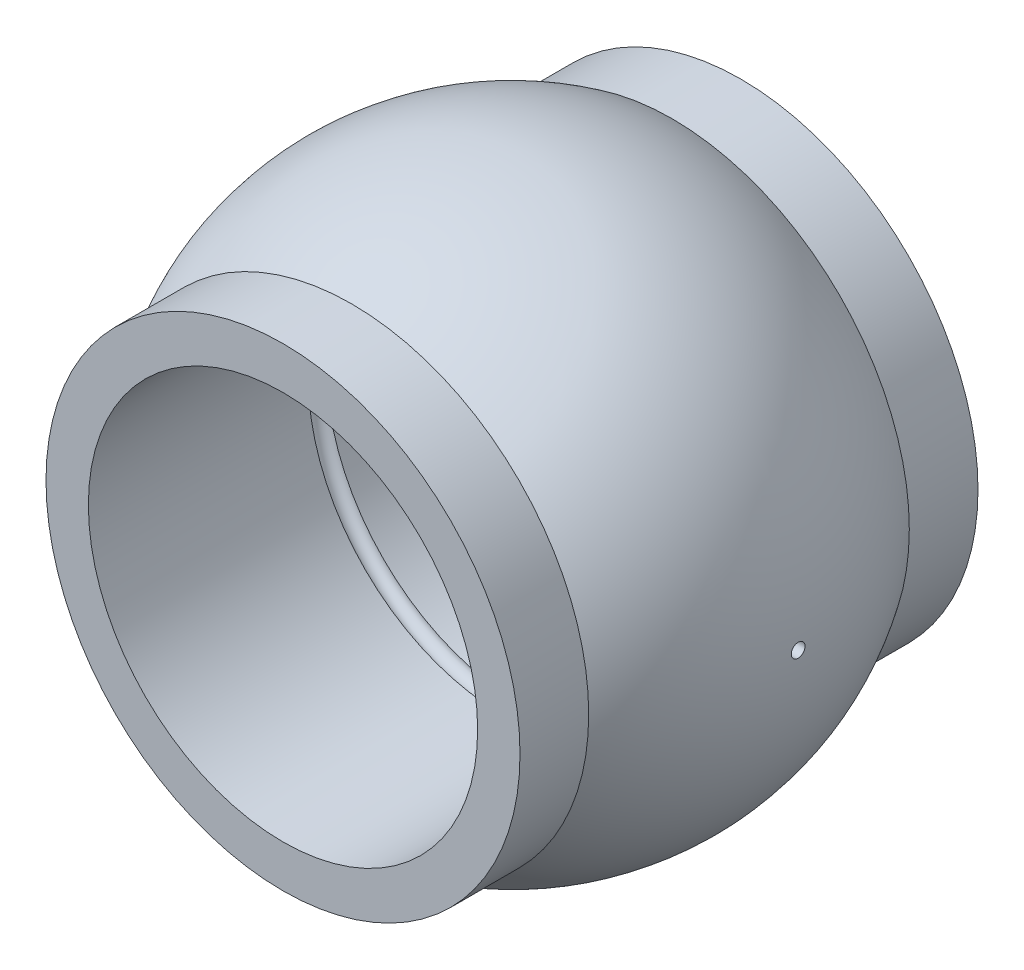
ISO-10303-21;
HEADER;
FILE_DESCRIPTION(('STEP AP214'),'2;1');
FILE_NAME('part.step','',(''),(''),'','','');
FILE_SCHEMA(('AUTOMOTIVE_DESIGN { 1 0 10303 214 1 1 1 1 }'));
ENDSEC;
DATA;
#1=APPLICATION_CONTEXT('core data for automotive mechanical design processes');
#2=APPLICATION_PROTOCOL_DEFINITION('international standard','automotive_design',2000,#1);
#3=PRODUCT_CONTEXT('',#1,'mechanical');
#4=PRODUCT('Part','Part','',(#3));
#5=PRODUCT_RELATED_PRODUCT_CATEGORY('part','',(#4));
#6=PRODUCT_DEFINITION_FORMATION('','',#4);
#7=PRODUCT_DEFINITION_CONTEXT('part definition',#1,'design');
#8=PRODUCT_DEFINITION('design','',#6,#7);
#9=PRODUCT_DEFINITION_SHAPE('','',#8);
#10=(LENGTH_UNIT() NAMED_UNIT(*) SI_UNIT(.MILLI.,.METRE.));
#11=(NAMED_UNIT(*) PLANE_ANGLE_UNIT() SI_UNIT($,.RADIAN.));
#12=(NAMED_UNIT(*) SI_UNIT($,.STERADIAN.) SOLID_ANGLE_UNIT());
#13=UNCERTAINTY_MEASURE_WITH_UNIT(LENGTH_MEASURE(1.E-05),#10,'distance_accuracy_value','');
#14=(GEOMETRIC_REPRESENTATION_CONTEXT(3) GLOBAL_UNCERTAINTY_ASSIGNED_CONTEXT((#13)) GLOBAL_UNIT_ASSIGNED_CONTEXT((#10,
#11,#12)) REPRESENTATION_CONTEXT('',''));
#15=CARTESIAN_POINT('',(0.,0.,0.));
#16=DIRECTION('',(0.,0.,1.));
#17=DIRECTION('',(1.,0.,0.));
#18=AXIS2_PLACEMENT_3D('',#15,#16,#17);
#19=CARTESIAN_POINT('',(69.,0.,0.));
#20=DIRECTION('',(0.,0.,-1.));
#21=DIRECTION('',(-1.,0.,0.));
#22=AXIS2_PLACEMENT_3D('',#19,#20,#21);
#23=TOROIDAL_SURFACE('',#22,8.50000000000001,0.4);
#24=CARTESIAN_POINT('',(69.,0.,-0.4));
#25=DIRECTION('',(0.,0.,-1.));
#26=DIRECTION('',(-1.,0.,0.));
#27=AXIS2_PLACEMENT_3D('',#24,#25,#26);
#28=CIRCLE('',#27,8.50000000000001);
#29=CARTESIAN_POINT('',(60.5,0.,-0.4));
#30=VERTEX_POINT('',#29);
#31=EDGE_CURVE('E36',#30,#30,#28,.T.);
#32=ORIENTED_EDGE('',*,*,#31,.T.);
#33=EDGE_LOOP('',(#32));
#34=FACE_BOUND('',#33,.T.);
#35=CARTESIAN_POINT('',(60.2354248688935,0.,0.299999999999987));
#36=CARTESIAN_POINT('',(60.235421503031,0.0141221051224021,0.299998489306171));
#37=CARTESIAN_POINT('',(60.2343019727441,0.0282560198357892,0.298991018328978));
#38=CARTESIAN_POINT('',(60.2300895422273,0.0559648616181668,0.295068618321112));
#39=CARTESIAN_POINT('',(60.2269907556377,0.0695379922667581,0.292147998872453));
#40=CARTESIAN_POINT('',(60.2194652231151,0.0956030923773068,0.284678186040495));
#41=CARTESIAN_POINT('',(60.21505681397,0.108107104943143,0.280151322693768));
#42=CARTESIAN_POINT('',(60.205446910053,0.132145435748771,0.269647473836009));
#43=CARTESIAN_POINT('',(60.2002454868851,0.143679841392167,0.26367061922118));
#44=CARTESIAN_POINT('',(60.1883802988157,0.168029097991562,0.249013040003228));
#45=CARTESIAN_POINT('',(60.1816352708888,0.180622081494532,0.240029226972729));
#46=CARTESIAN_POINT('',(60.1682070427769,0.204319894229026,0.220209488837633));
#47=CARTESIAN_POINT('',(60.1615239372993,0.215422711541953,0.209371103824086));
#48=CARTESIAN_POINT('',(60.1475351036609,0.237852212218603,0.183757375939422));
#49=CARTESIAN_POINT('',(60.1403400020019,0.24884644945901,0.168624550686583));
#50=CARTESIAN_POINT('',(60.1274966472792,0.268017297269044,0.136091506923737));
#51=CARTESIAN_POINT('',(60.1218450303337,0.276200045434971,0.118696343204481));
#52=CARTESIAN_POINT('',(60.1140704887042,0.287326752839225,0.0873811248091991));
#53=CARTESIAN_POINT('',(60.1114006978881,0.291099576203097,0.0738887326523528));
#54=CARTESIAN_POINT('',(60.1073968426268,0.296734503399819,0.0463239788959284));
#55=CARTESIAN_POINT('',(60.1060613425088,0.298598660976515,0.0322522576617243));
#56=CARTESIAN_POINT('',(60.1048344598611,0.300311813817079,0.00388974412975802));
#57=CARTESIAN_POINT('',(60.104946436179,0.300156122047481,-0.0104014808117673));
#58=CARTESIAN_POINT('',(60.1066121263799,0.297828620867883,-0.0387335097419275));
#59=CARTESIAN_POINT('',(60.108166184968,0.29565632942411,-0.0527742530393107));
#60=CARTESIAN_POINT('',(60.1125247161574,0.289510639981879,-0.0798144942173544));
#61=CARTESIAN_POINT('',(60.1152921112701,0.285590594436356,-0.092832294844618));
#62=CARTESIAN_POINT('',(60.1218698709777,0.276146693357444,-0.118002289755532));
#63=CARTESIAN_POINT('',(60.1256821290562,0.27061992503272,-0.130152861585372));
#64=CARTESIAN_POINT('',(60.139240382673,0.25061573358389,-0.16744621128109));
#65=CARTESIAN_POINT('',(60.1505986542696,0.233380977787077,-0.190589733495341));
#66=CARTESIAN_POINT('',(60.1696494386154,0.201834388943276,-0.22258785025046));
#67=CARTESIAN_POINT('',(60.1769600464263,0.189172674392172,-0.233430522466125));
#68=CARTESIAN_POINT('',(60.1913694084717,0.162170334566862,-0.252941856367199));
#69=CARTESIAN_POINT('',(60.1984680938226,0.147829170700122,-0.261609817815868));
#70=CARTESIAN_POINT('',(60.2153217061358,0.108867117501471,-0.28078414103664));
#71=CARTESIAN_POINT('',(60.2243561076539,0.0829672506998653,-0.28962870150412));
#72=CARTESIAN_POINT('',(60.2316145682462,0.0466256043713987,-0.296499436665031));
#73=CARTESIAN_POINT('',(60.2330292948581,0.0374038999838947,-0.297806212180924));
#74=CARTESIAN_POINT('',(60.2349350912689,0.0187897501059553,-0.299556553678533));
#75=CARTESIAN_POINT('',(60.2354271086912,0.00939748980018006,-0.300001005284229));
#76=CARTESIAN_POINT('',(60.235421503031,-0.0141221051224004,-0.299998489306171));
#77=CARTESIAN_POINT('',(60.2343019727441,-0.0282560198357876,-0.298991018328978));
#78=CARTESIAN_POINT('',(60.2300895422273,-0.055964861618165,-0.295068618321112));
#79=CARTESIAN_POINT('',(60.2269907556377,-0.0695379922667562,-0.292147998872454));
#80=CARTESIAN_POINT('',(60.2194652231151,-0.0956030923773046,-0.284678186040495));
#81=CARTESIAN_POINT('',(60.21505681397,-0.108107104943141,-0.280151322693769));
#82=CARTESIAN_POINT('',(60.205446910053,-0.132145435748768,-0.26964747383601));
#83=CARTESIAN_POINT('',(60.2002454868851,-0.143679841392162,-0.263670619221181));
#84=CARTESIAN_POINT('',(60.1883802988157,-0.168029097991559,-0.249013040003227));
#85=CARTESIAN_POINT('',(60.1816352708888,-0.180622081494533,-0.240029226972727));
#86=CARTESIAN_POINT('',(60.1682070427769,-0.20431989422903,-0.220209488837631));
#87=CARTESIAN_POINT('',(60.1615239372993,-0.215422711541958,-0.209371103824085));
#88=CARTESIAN_POINT('',(60.1475351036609,-0.237852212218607,-0.183757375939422));
#89=CARTESIAN_POINT('',(60.1403400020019,-0.248846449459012,-0.168624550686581));
#90=CARTESIAN_POINT('',(60.1274966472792,-0.268017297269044,-0.136091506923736));
#91=CARTESIAN_POINT('',(60.1218450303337,-0.276200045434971,-0.118696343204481));
#92=CARTESIAN_POINT('',(60.1140704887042,-0.287326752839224,-0.0873811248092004));
#93=CARTESIAN_POINT('',(60.1114006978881,-0.291099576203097,-0.073888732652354));
#94=CARTESIAN_POINT('',(60.1073968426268,-0.296734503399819,-0.0463239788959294));
#95=CARTESIAN_POINT('',(60.1060613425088,-0.298598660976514,-0.0322522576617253));
#96=CARTESIAN_POINT('',(60.1048344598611,-0.300311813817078,-0.00388974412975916));
#97=CARTESIAN_POINT('',(60.104946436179,-0.30015612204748,0.0104014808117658));
#98=CARTESIAN_POINT('',(60.1066121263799,-0.297828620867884,0.0387335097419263));
#99=CARTESIAN_POINT('',(60.108166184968,-0.295656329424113,0.0527742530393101));
#100=CARTESIAN_POINT('',(60.1125247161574,-0.289510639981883,0.0798144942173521));
#101=CARTESIAN_POINT('',(60.1152921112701,-0.285590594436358,0.0928322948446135));
#102=CARTESIAN_POINT('',(60.1218698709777,-0.276146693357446,0.118002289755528));
#103=CARTESIAN_POINT('',(60.1256821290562,-0.270619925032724,0.130152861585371));
#104=CARTESIAN_POINT('',(60.139240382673,-0.250615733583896,0.167446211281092));
#105=CARTESIAN_POINT('',(60.1505986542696,-0.233380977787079,0.190589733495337));
#106=CARTESIAN_POINT('',(60.1696494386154,-0.201834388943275,0.222587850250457));
#107=CARTESIAN_POINT('',(60.1769600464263,-0.189172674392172,0.233430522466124));
#108=CARTESIAN_POINT('',(60.1913694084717,-0.162170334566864,0.252941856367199));
#109=CARTESIAN_POINT('',(60.1984680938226,-0.147829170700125,0.261609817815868));
#110=CARTESIAN_POINT('',(60.2153217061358,-0.108867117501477,0.280784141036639));
#111=CARTESIAN_POINT('',(60.2243561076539,-0.0829672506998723,0.289628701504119));
#112=CARTESIAN_POINT('',(60.2316145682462,-0.0466256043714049,0.29649943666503));
#113=CARTESIAN_POINT('',(60.2330292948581,-0.0374038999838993,0.297806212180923));
#114=CARTESIAN_POINT('',(60.2349350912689,-0.0187897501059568,0.299556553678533));
#115=CARTESIAN_POINT('',(60.2354271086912,-0.00939748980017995,0.300001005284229));
#116=CARTESIAN_POINT('',(60.2354248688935,0.,0.299999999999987));
#117=B_SPLINE_CURVE_WITH_KNOTS('',3,(#35,#36,#37,#38,#39,#40,#41,#42,#43,#44,#45,#46,#47,#48,
#49,#50,#51,#52,#53,#54,#55,#56,#57,#58,#59,#60,#61,#62,#63,#64,#65,#66,#67,#68,#69,#70,#71,#72,
#73,#74,#75,#76,#77,#78,#79,#80,#81,#82,#83,#84,#85,#86,#87,#88,#89,#90,#91,#92,#93,#94,#95,#96,
#97,#98,#99,#100,#101,#102,#103,#104,#105,#106,#107,#108,#109,#110,#111,#112,#113,#114,#115,
#116),.UNSPECIFIED.,.T.,.F.,(4,2,2,2,2,2,2,2,2,2,2,2,2,2,2,2,2,2,2,2,2,2,2,2,2,2,2,2,2,2,2,2,2,
2,2,2,2,2,2,2,4),(0.,0.0423173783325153,0.0847611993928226,0.12663670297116,0.168508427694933,
0.218959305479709,0.269477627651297,0.329261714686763,0.388914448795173,0.431518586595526,
0.47407683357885,0.51673385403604,0.559401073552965,0.600846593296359,0.642367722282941,
0.733952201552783,0.78838717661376,0.842839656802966,0.927598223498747,0.9557870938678,
0.983946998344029,1.02626437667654,1.06870819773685,1.11058370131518,1.15245542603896,
1.20290630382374,1.25342462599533,1.31320871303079,1.3728614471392,1.41546558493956,
1.45802383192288,1.50068085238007,1.54334807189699,1.58479359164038,1.62631472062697,
1.71789919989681,1.77233417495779,1.82678665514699,1.91154522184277,1.93973409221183,
1.96789399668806),.UNSPECIFIED.);
#118=CARTESIAN_POINT('',(60.2354248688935,0.,0.299999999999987));
#119=VERTEX_POINT('',#118);
#120=EDGE_CURVE('E19',#119,#119,#117,.T.);
#121=ORIENTED_EDGE('',*,*,#120,.T.);
#122=EDGE_LOOP('',(#121));
#123=FACE_BOUND('',#122,.T.);
#124=CARTESIAN_POINT('',(69.,0.,0.4));
#125=DIRECTION('',(0.,0.,-1.));
#126=DIRECTION('',(-1.,0.,0.));
#127=AXIS2_PLACEMENT_3D('',#124,#125,#126);
#128=CIRCLE('',#127,8.5);
#129=CARTESIAN_POINT('',(60.5,0.,0.4));
#130=VERTEX_POINT('',#129);
#131=EDGE_CURVE('E39',#130,#130,#128,.F.);
#132=ORIENTED_EDGE('',*,*,#131,.T.);
#133=EDGE_LOOP('',(#132));
#134=FACE_BOUND('',#133,.T.);
#135=CARTESIAN_POINT('',(77.7645751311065,-4.96544178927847E-12,-0.299999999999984));
#136=CARTESIAN_POINT('',(77.7645784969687,0.0141221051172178,-0.299998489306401));
#137=CARTESIAN_POINT('',(77.7656980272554,0.0282560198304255,-0.298991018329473));
#138=CARTESIAN_POINT('',(77.7699104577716,0.055964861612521,-0.29506861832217));
#139=CARTESIAN_POINT('',(77.7730092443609,0.06953799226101,-0.292147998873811));
#140=CARTESIAN_POINT('',(77.780534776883,0.0956030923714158,-0.284678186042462));
#141=CARTESIAN_POINT('',(77.7849431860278,0.10810710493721,-0.280151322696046));
#142=CARTESIAN_POINT('',(77.7945530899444,0.132145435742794,-0.269647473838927));
#143=CARTESIAN_POINT('',(77.7997545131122,0.143679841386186,-0.263670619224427));
#144=CARTESIAN_POINT('',(77.8116197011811,0.168029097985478,-0.249013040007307));
#145=CARTESIAN_POINT('',(77.8183647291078,0.18062208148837,-0.240029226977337));
#146=CARTESIAN_POINT('',(77.8317929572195,0.204319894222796,-0.220209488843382));
#147=CARTESIAN_POINT('',(77.8384760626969,0.215422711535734,-0.209371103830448));
#148=CARTESIAN_POINT('',(77.8524648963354,0.23785221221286,-0.183757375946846));
#149=CARTESIAN_POINT('',(77.8596599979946,0.248846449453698,-0.168624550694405));
#150=CARTESIAN_POINT('',(77.8725033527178,0.268017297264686,-0.136091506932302));
#151=CARTESIAN_POINT('',(77.8781549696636,0.276200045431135,-0.118696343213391));
#152=CARTESIAN_POINT('',(77.8859295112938,0.287326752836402,-0.087381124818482));
#153=CARTESIAN_POINT('',(77.8885993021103,0.291099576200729,-0.0738887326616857));
#154=CARTESIAN_POINT('',(77.8926031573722,0.296734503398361,-0.0463239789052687));
#155=CARTESIAN_POINT('',(77.8939386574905,0.298598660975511,-0.0322522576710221));
#156=CARTESIAN_POINT('',(77.8951655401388,0.300311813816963,-0.00388974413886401));
#157=CARTESIAN_POINT('',(77.8950535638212,0.300156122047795,0.0104014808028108));
#158=CARTESIAN_POINT('',(77.8933878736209,0.297828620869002,0.0387335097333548));
#159=CARTESIAN_POINT('',(77.8918338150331,0.295656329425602,0.0527742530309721));
#160=CARTESIAN_POINT('',(77.8874752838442,0.289510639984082,0.0798144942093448));
#161=CARTESIAN_POINT('',(77.8847078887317,0.285590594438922,0.0928322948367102));
#162=CARTESIAN_POINT('',(77.8781301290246,0.276146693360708,0.118002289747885));
#163=CARTESIAN_POINT('',(77.8743178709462,0.270619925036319,0.130152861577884));
#164=CARTESIAN_POINT('',(77.8607596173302,0.250615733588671,0.167446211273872));
#165=CARTESIAN_POINT('',(77.8494013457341,0.23338097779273,0.190589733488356));
#166=CARTESIAN_POINT('',(77.8303505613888,0.201834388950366,0.222587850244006));
#167=CARTESIAN_POINT('',(77.8230399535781,0.189172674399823,0.233430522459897));
#168=CARTESIAN_POINT('',(77.8086305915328,0.162170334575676,0.252941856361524));
#169=CARTESIAN_POINT('',(77.8015319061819,0.147829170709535,0.261609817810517));
#170=CARTESIAN_POINT('',(77.7846782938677,0.108867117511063,0.280784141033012));
#171=CARTESIAN_POINT('',(77.7756438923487,0.0829672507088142,0.289628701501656));
#172=CARTESIAN_POINT('',(77.768385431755,0.0466256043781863,0.296499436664));
#173=CARTESIAN_POINT('',(77.7669707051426,0.0374038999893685,0.297806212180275));
#174=CARTESIAN_POINT('',(77.7650649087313,0.0187897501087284,0.299556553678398));
#175=CARTESIAN_POINT('',(77.7645728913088,0.00939748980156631,0.300001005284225));
#176=CARTESIAN_POINT('',(77.764578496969,-0.0141221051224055,0.299998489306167));
#177=CARTESIAN_POINT('',(77.7656980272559,-0.0282560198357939,0.298991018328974));
#178=CARTESIAN_POINT('',(77.7699104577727,-0.0559648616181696,0.295068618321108));
#179=CARTESIAN_POINT('',(77.7730092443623,-0.0695379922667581,0.29214799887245));
#180=CARTESIAN_POINT('',(77.780534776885,-0.0956030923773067,0.284678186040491));
#181=CARTESIAN_POINT('',(77.78494318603,-0.108107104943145,0.280151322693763));
#182=CARTESIAN_POINT('',(77.794553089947,-0.132145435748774,0.269647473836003));
#183=CARTESIAN_POINT('',(77.7997545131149,-0.143679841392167,0.263670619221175));
#184=CARTESIAN_POINT('',(77.8116197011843,-0.168029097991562,0.249013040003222));
#185=CARTESIAN_POINT('',(77.8183647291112,-0.180622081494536,0.240029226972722));
#186=CARTESIAN_POINT('',(77.8317929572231,-0.204319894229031,0.220209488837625));
#187=CARTESIAN_POINT('',(77.8384760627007,-0.215422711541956,0.209371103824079));
#188=CARTESIAN_POINT('',(77.8524648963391,-0.237852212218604,0.183757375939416));
#189=CARTESIAN_POINT('',(77.8596599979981,-0.24884644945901,0.168624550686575));
#190=CARTESIAN_POINT('',(77.8725033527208,-0.268017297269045,0.136091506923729));
#191=CARTESIAN_POINT('',(77.8781549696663,-0.276200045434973,0.118696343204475));
#192=CARTESIAN_POINT('',(77.8859295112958,-0.287326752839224,0.0873811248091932));
#193=CARTESIAN_POINT('',(77.8885993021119,-0.291099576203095,0.0738887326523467));
#194=CARTESIAN_POINT('',(77.8926031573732,-0.296734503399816,0.046323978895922));
#195=CARTESIAN_POINT('',(77.8939386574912,-0.298598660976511,0.0322522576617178));
#196=CARTESIAN_POINT('',(77.8951655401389,-0.300311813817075,0.00388974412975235));
#197=CARTESIAN_POINT('',(77.895053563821,-0.300156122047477,-0.0104014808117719));
#198=CARTESIAN_POINT('',(77.8933878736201,-0.297828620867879,-0.0387335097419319));
#199=CARTESIAN_POINT('',(77.891833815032,-0.295656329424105,-0.0527742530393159));
#200=CARTESIAN_POINT('',(77.8874752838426,-0.289510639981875,-0.0798144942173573));
#201=CARTESIAN_POINT('',(77.8847078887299,-0.285590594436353,-0.0928322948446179));
#202=CARTESIAN_POINT('',(77.8781301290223,-0.27614669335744,-0.118002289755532));
#203=CARTESIAN_POINT('',(77.8743178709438,-0.270619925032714,-0.130152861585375));
#204=CARTESIAN_POINT('',(77.860759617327,-0.250615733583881,-0.167446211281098));
#205=CARTESIAN_POINT('',(77.8494013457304,-0.233380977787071,-0.190589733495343));
#206=CARTESIAN_POINT('',(77.8303505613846,-0.201834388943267,-0.222587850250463));
#207=CARTESIAN_POINT('',(77.8230399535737,-0.189172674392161,-0.233430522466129));
#208=CARTESIAN_POINT('',(77.8086305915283,-0.162170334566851,-0.252941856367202));
#209=CARTESIAN_POINT('',(77.8015319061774,-0.147829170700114,-0.261609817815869));
#210=CARTESIAN_POINT('',(77.7846782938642,-0.108867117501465,-0.280784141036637));
#211=CARTESIAN_POINT('',(77.7756438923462,-0.0829672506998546,-0.289628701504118));
#212=CARTESIAN_POINT('',(77.768385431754,-0.0466256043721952,-0.296499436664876));
#213=CARTESIAN_POINT('',(77.7669707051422,-0.0374038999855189,-0.29780621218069));
#214=CARTESIAN_POINT('',(77.7650649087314,-0.0187897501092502,-0.299556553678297));
#215=CARTESIAN_POINT('',(77.764572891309,-0.00939748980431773,-0.30000100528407));
#216=CARTESIAN_POINT('',(77.7645751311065,-4.96544178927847E-12,-0.299999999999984));
#217=B_SPLINE_CURVE_WITH_KNOTS('',3,(#135,#136,#137,#138,#139,#140,#141,#142,#143,#144,#145,
#146,#147,#148,#149,#150,#151,#152,#153,#154,#155,#156,#157,#158,#159,#160,#161,#162,#163,#164,
#165,#166,#167,#168,#169,#170,#171,#172,#173,#174,#175,#176,#177,#178,#179,#180,#181,#182,#183,
#184,#185,#186,#187,#188,#189,#190,#191,#192,#193,#194,#195,#196,#197,#198,#199,#200,#201,#202,
#203,#204,#205,#206,#207,#208,#209,#210,#211,#212,#213,#214,#215,#216),.UNSPECIFIED.,.T.,.F.,(4,
2,2,2,2,2,2,2,2,2,2,2,2,2,2,2,2,2,2,2,2,2,2,2,2,2,2,2,2,2,2,2,2,2,2,2,2,2,2,2,4),(0.,
0.042317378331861,0.0847611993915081,0.126636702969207,0.168508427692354,0.218959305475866,
0.269477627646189,0.329261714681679,0.388914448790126,0.431518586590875,0.474076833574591,
0.516733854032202,0.559401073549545,0.600846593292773,0.642367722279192,0.733952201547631,
0.788387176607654,0.842839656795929,0.927598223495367,0.95578709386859,0.983946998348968,
1.02626437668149,1.0687081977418,1.11058370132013,1.15245542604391,1.20290630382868,
1.25342462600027,1.31320871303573,1.37286144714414,1.4154655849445,1.45802383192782,
1.50068085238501,1.54334807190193,1.58479359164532,1.6263147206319,1.71789919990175,
1.77233417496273,1.82678665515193,1.91154522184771,1.93973409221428,1.96789399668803),.UNSPECIFIED.);
#218=CARTESIAN_POINT('',(77.7645751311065,-4.96544178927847E-12,-0.299999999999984));
#219=VERTEX_POINT('',#218);
#220=EDGE_CURVE('E89',#219,#219,#217,.T.);
#221=ORIENTED_EDGE('',*,*,#220,.T.);
#222=EDGE_LOOP('',(#221));
#223=FACE_BOUND('',#222,.T.);
#224=ADVANCED_FACE('F14',(#34,#123,#134,#223),#23,.F.);
#225=CARTESIAN_POINT('',(69.,0.,7.));
#226=DIRECTION('',(0.,0.,-1.));
#227=DIRECTION('',(-1.,0.,0.));
#228=AXIS2_PLACEMENT_3D('',#225,#226,#227);
#229=CYLINDRICAL_SURFACE('',#228,8.5);
#230=CARTESIAN_POINT('',(69.,0.,10.));
#231=DIRECTION('',(0.,0.,-1.));
#232=DIRECTION('',(-1.,0.,0.));
#233=AXIS2_PLACEMENT_3D('',#230,#231,#232);
#234=CIRCLE('',#233,8.5);
#235=CARTESIAN_POINT('',(60.5,0.,10.));
#236=VERTEX_POINT('',#235);
#237=EDGE_CURVE('E85',#236,#236,#234,.T.);
#238=ORIENTED_EDGE('',*,*,#237,.F.);
#239=EDGE_LOOP('',(#238));
#240=FACE_BOUND('',#239,.T.);
#241=ORIENTED_EDGE('',*,*,#131,.F.);
#242=EDGE_LOOP('',(#241));
#243=FACE_BOUND('',#242,.T.);
#244=ADVANCED_FACE('F121',(#240,#243),#229,.F.);
#245=CARTESIAN_POINT('',(69.,0.,7.));
#246=DIRECTION('',(0.,0.,-1.));
#247=DIRECTION('',(-1.,0.,0.));
#248=AXIS2_PLACEMENT_3D('',#245,#246,#247);
#249=CYLINDRICAL_SURFACE('',#248,8.50000000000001);
#250=ORIENTED_EDGE('',*,*,#31,.F.);
#251=EDGE_LOOP('',(#250));
#252=FACE_BOUND('',#251,.T.);
#253=CARTESIAN_POINT('',(69.,0.,-10.));
#254=DIRECTION('',(0.,0.,-1.));
#255=DIRECTION('',(-1.,0.,0.));
#256=AXIS2_PLACEMENT_3D('',#253,#254,#255);
#257=CIRCLE('',#256,8.50000000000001);
#258=CARTESIAN_POINT('',(60.5,0.,-10.));
#259=VERTEX_POINT('',#258);
#260=EDGE_CURVE('E81',#259,#259,#257,.F.);
#261=ORIENTED_EDGE('',*,*,#260,.F.);
#262=EDGE_LOOP('',(#261));
#263=FACE_BOUND('',#262,.T.);
#264=ADVANCED_FACE('F118',(#252,#263),#249,.F.);
#265=CARTESIAN_POINT('',(69.,0.,10.));
#266=DIRECTION('',(0.,0.,1.));
#267=DIRECTION('',(1.,0.,0.));
#268=AXIS2_PLACEMENT_3D('',#265,#266,#267);
#269=PLANE('',#268);
#270=ORIENTED_EDGE('',*,*,#237,.T.);
#271=EDGE_LOOP('',(#270));
#272=FACE_BOUND('',#271,.T.);
#273=CARTESIAN_POINT('',(69.,0.,10.));
#274=DIRECTION('',(0.,0.,-1.));
#275=DIRECTION('',(-1.,0.,0.));
#276=AXIS2_PLACEMENT_3D('',#273,#274,#275);
#277=CIRCLE('',#276,10.3500000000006);
#278=CARTESIAN_POINT('',(58.6499999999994,0.,10.));
#279=VERTEX_POINT('',#278);
#280=EDGE_CURVE('E78',#279,#279,#277,.T.);
#281=ORIENTED_EDGE('',*,*,#280,.F.);
#282=EDGE_LOOP('',(#281));
#283=FACE_BOUND('',#282,.T.);
#284=ADVANCED_FACE('F110',(#272,#283),#269,.T.);
#285=CARTESIAN_POINT('',(69.,0.,-10.));
#286=DIRECTION('',(0.,0.,-1.));
#287=DIRECTION('',(-1.,0.,0.));
#288=AXIS2_PLACEMENT_3D('',#285,#286,#287);
#289=PLANE('',#288);
#290=CARTESIAN_POINT('',(69.,0.,-10.));
#291=DIRECTION('',(0.,0.,1.));
#292=DIRECTION('',(1.,0.,0.));
#293=AXIS2_PLACEMENT_3D('',#290,#291,#292);
#294=CIRCLE('',#293,10.3500000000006);
#295=CARTESIAN_POINT('',(79.3500000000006,0.,-10.));
#296=VERTEX_POINT('',#295);
#297=EDGE_CURVE('E80',#296,#296,#294,.T.);
#298=ORIENTED_EDGE('',*,*,#297,.F.);
#299=EDGE_LOOP('',(#298));
#300=FACE_BOUND('',#299,.T.);
#301=ORIENTED_EDGE('',*,*,#260,.T.);
#302=EDGE_LOOP('',(#301));
#303=FACE_BOUND('',#302,.T.);
#304=ADVANCED_FACE('F102',(#300,#303),#289,.T.);
#305=CARTESIAN_POINT('',(60.2354248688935,0.,0.));
#306=DIRECTION('',(1.,0.,0.));
#307=DIRECTION('',(0.,0.,-1.));
#308=AXIS2_PLACEMENT_3D('',#305,#306,#307);
#309=CYLINDRICAL_SURFACE('',#308,0.299999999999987);
#310=ORIENTED_EDGE('',*,*,#120,.F.);
#311=EDGE_LOOP('',(#310));
#312=FACE_BOUND('',#311,.T.);
#313=CARTESIAN_POINT('',(56.5036090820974,0.,0.299999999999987));
#314=CARTESIAN_POINT('',(56.5036090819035,-0.0168414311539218,0.299998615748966));
#315=CARTESIAN_POINT('',(56.5036090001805,-0.0336981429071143,0.298576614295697));
#316=CARTESIAN_POINT('',(56.5036086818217,-0.0669618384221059,0.292919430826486));
#317=CARTESIAN_POINT('',(56.5036084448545,-0.0833677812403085,0.288678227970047));
#318=CARTESIAN_POINT('',(56.5036078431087,-0.115207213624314,0.277508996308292));
#319=CARTESIAN_POINT('',(56.5036074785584,-0.130642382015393,0.270585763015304));
#320=CARTESIAN_POINT('',(56.5036066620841,-0.160153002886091,0.254236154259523));
#321=CARTESIAN_POINT('',(56.5036062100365,-0.174226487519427,0.244806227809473));
#322=CARTESIAN_POINT('',(56.503605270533,-0.200570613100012,0.223731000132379));
#323=CARTESIAN_POINT('',(56.503604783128,-0.21284376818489,0.212088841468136));
#324=CARTESIAN_POINT('',(56.503603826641,-0.235278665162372,0.186892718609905));
#325=CARTESIAN_POINT('',(56.5036033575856,-0.245437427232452,0.173336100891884));
#326=CARTESIAN_POINT('',(56.5036024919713,-0.263320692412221,0.144728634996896));
#327=CARTESIAN_POINT('',(56.5036020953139,-0.271048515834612,0.129679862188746));
#328=CARTESIAN_POINT('',(56.5036014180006,-0.283878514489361,0.0984779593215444));
#329=CARTESIAN_POINT('',(56.5036011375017,-0.288977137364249,0.0823233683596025));
#330=CARTESIAN_POINT('',(56.5036007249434,-0.296385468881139,0.0493983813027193));
#331=CARTESIAN_POINT('',(56.5036005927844,-0.298697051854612,0.0326284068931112));
#332=CARTESIAN_POINT('',(56.5036004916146,-0.300471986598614,-0.0010615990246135));
#333=CARTESIAN_POINT('',(56.5036005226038,-0.299935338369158,-0.0179816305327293));
#334=CARTESIAN_POINT('',(56.5036007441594,-0.296027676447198,-0.0515027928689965));
#335=CARTESIAN_POINT('',(56.5036009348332,-0.292654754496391,-0.0681037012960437));
#336=CARTESIAN_POINT('',(56.5036014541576,-0.283174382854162,-0.10048101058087));
#337=CARTESIAN_POINT('',(56.5036017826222,-0.277070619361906,-0.11625849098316));
#338=CARTESIAN_POINT('',(56.5036025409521,-0.262292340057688,-0.146586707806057));
#339=CARTESIAN_POINT('',(56.503602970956,-0.253614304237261,-0.161135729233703));
#340=CARTESIAN_POINT('',(56.5036038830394,-0.233951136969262,-0.188549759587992));
#341=CARTESIAN_POINT('',(56.5036043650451,-0.222969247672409,-0.201417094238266));
#342=CARTESIAN_POINT('',(56.5036053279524,-0.198985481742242,-0.225143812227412));
#343=CARTESIAN_POINT('',(56.5036058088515,-0.185980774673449,-0.23600033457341));
#344=CARTESIAN_POINT('',(56.5036067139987,-0.158351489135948,-0.255360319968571));
#345=CARTESIAN_POINT('',(56.5036071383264,-0.14372924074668,-0.263867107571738));
#346=CARTESIAN_POINT('',(56.503607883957,-0.113239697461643,-0.278320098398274));
#347=CARTESIAN_POINT('',(56.5036082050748,-0.0973702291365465,-0.284261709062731));
#348=CARTESIAN_POINT('',(56.5036087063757,-0.0648851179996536,-0.293382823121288));
#349=CARTESIAN_POINT('',(56.5036088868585,-0.0482711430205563,-0.296568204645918));
#350=CARTESIAN_POINT('',(56.5036090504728,-0.0210523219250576,-0.299446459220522));
#351=CARTESIAN_POINT('',(56.5036090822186,-0.0105291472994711,-0.300000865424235));
#352=CARTESIAN_POINT('',(56.5036090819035,0.0168414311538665,-0.299998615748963));
#353=CARTESIAN_POINT('',(56.5036090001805,0.0336981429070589,-0.2985766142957));
#354=CARTESIAN_POINT('',(56.5036086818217,0.0669618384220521,-0.292919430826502));
#355=CARTESIAN_POINT('',(56.5036084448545,0.0833677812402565,-0.28867822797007));
#356=CARTESIAN_POINT('',(56.5036078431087,0.115207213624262,-0.277508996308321));
#357=CARTESIAN_POINT('',(56.5036074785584,0.130642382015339,-0.27058576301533));
#358=CARTESIAN_POINT('',(56.5036066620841,0.16015300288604,-0.254236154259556));
#359=CARTESIAN_POINT('',(56.5036062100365,0.174226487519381,-0.244806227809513));
#360=CARTESIAN_POINT('',(56.503605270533,0.20057061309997,-0.223731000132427));
#361=CARTESIAN_POINT('',(56.503604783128,0.212843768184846,-0.212088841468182));
#362=CARTESIAN_POINT('',(56.503603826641,0.235278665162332,-0.186892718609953));
#363=CARTESIAN_POINT('',(56.5036033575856,0.245437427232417,-0.173336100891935));
#364=CARTESIAN_POINT('',(56.5036024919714,0.263320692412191,-0.144728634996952));
#365=CARTESIAN_POINT('',(56.5036020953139,0.271048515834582,-0.129679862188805));
#366=CARTESIAN_POINT('',(56.5036014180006,0.283878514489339,-0.0984779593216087));
#367=CARTESIAN_POINT('',(56.5036011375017,0.288977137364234,-0.0823233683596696));
#368=CARTESIAN_POINT('',(56.5036007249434,0.296385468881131,-0.049398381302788));
#369=CARTESIAN_POINT('',(56.5036005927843,0.298697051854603,-0.0326284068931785));
#370=CARTESIAN_POINT('',(56.5036004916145,0.300471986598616,0.00106159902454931));
#371=CARTESIAN_POINT('',(56.5036005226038,0.299935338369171,0.0179816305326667));
#372=CARTESIAN_POINT('',(56.5036007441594,0.29602767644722,0.0515027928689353));
#373=CARTESIAN_POINT('',(56.5036009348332,0.292654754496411,0.0681037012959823));
#374=CARTESIAN_POINT('',(56.5036014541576,0.283174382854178,0.100481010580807));
#375=CARTESIAN_POINT('',(56.5036017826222,0.277070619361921,0.116258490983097));
#376=CARTESIAN_POINT('',(56.5036025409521,0.262292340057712,0.146586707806));
#377=CARTESIAN_POINT('',(56.503602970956,0.253614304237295,0.161135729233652));
#378=CARTESIAN_POINT('',(56.5036038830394,0.2339511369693,0.188549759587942));
#379=CARTESIAN_POINT('',(56.5036043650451,0.222969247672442,0.20141709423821));
#380=CARTESIAN_POINT('',(56.5036053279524,0.198985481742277,0.225143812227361));
#381=CARTESIAN_POINT('',(56.5036058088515,0.185980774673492,0.236000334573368));
#382=CARTESIAN_POINT('',(56.5036067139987,0.158351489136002,0.255360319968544));
#383=CARTESIAN_POINT('',(56.5036071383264,0.143729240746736,0.263867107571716));
#384=CARTESIAN_POINT('',(56.503607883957,0.113239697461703,0.278320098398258));
#385=CARTESIAN_POINT('',(56.5036082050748,0.0973702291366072,0.284261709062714));
#386=CARTESIAN_POINT('',(56.5036087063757,0.0648851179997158,0.29338282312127));
#387=CARTESIAN_POINT('',(56.5036088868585,0.0482711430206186,0.296568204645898));
#388=CARTESIAN_POINT('',(56.5036090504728,0.0210523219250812,0.299446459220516));
#389=CARTESIAN_POINT('',(56.5036090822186,0.0105291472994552,0.300000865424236));
#390=CARTESIAN_POINT('',(56.5036090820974,0.,0.299999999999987));
#391=B_SPLINE_CURVE_WITH_KNOTS('',3,(#313,#314,#315,#316,#317,#318,#319,#320,#321,#322,#323,
#324,#325,#326,#327,#328,#329,#330,#331,#332,#333,#334,#335,#336,#337,#338,#339,#340,#341,#342,
#343,#344,#345,#346,#347,#348,#349,#350,#351,#352,#353,#354,#355,#356,#357,#358,#359,#360,#361,
#362,#363,#364,#365,#366,#367,#368,#369,#370,#371,#372,#373,#374,#375,#376,#377,#378,#379,#380,
#381,#382,#383,#384,#385,#386,#387,#388,#389,#390),.UNSPECIFIED.,.T.,.F.,(4,2,2,2,2,2,2,2,2,2,2,
2,2,2,2,2,2,2,2,2,2,2,2,2,2,2,2,2,2,2,2,2,2,2,2,2,2,2,4),(0.,0.0504912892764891,
0.101090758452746,0.151600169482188,0.202181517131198,0.252691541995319,0.303272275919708,
0.353783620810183,0.404363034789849,0.454908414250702,0.505453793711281,0.55603320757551,
0.606544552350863,0.65712528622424,0.707635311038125,0.758216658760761,0.808726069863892,
0.859325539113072,0.909816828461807,0.941383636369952,0.991874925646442,1.0424743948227,
1.09298380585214,1.14356515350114,1.19407517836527,1.24465591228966,1.29516725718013,
1.34574667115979,1.39629205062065,1.44683743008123,1.49741684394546,1.54792818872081,
1.59850892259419,1.64901894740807,1.69960029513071,1.75010970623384,1.80070917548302,
1.85120046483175,1.88276727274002),.UNSPECIFIED.);
#392=CARTESIAN_POINT('',(56.5036090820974,0.,0.299999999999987));
#393=VERTEX_POINT('',#392);
#394=EDGE_CURVE('E48',#393,#393,#391,.T.);
#395=ORIENTED_EDGE('',*,*,#394,.F.);
#396=EDGE_LOOP('',(#395));
#397=FACE_BOUND('',#396,.T.);
#398=ADVANCED_FACE('F72',(#312,#397),#309,.F.);
#399=CARTESIAN_POINT('',(77.7645751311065,0.,0.));
#400=DIRECTION('',(-1.,0.,0.));
#401=DIRECTION('',(0.,0.,1.));
#402=AXIS2_PLACEMENT_3D('',#399,#400,#401);
#403=CYLINDRICAL_SURFACE('',#402,0.299999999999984);
#404=ORIENTED_EDGE('',*,*,#220,.F.);
#405=EDGE_LOOP('',(#404));
#406=FACE_BOUND('',#405,.T.);
#407=CARTESIAN_POINT('',(81.4963909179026,-1.8409077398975E-12,-0.299999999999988));
#408=CARTESIAN_POINT('',(81.4963909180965,-0.0168414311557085,-0.299998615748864));
#409=CARTESIAN_POINT('',(81.4963909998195,-0.0336981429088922,-0.298576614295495));
#410=CARTESIAN_POINT('',(81.4963913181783,-0.0669618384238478,-0.292919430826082));
#411=CARTESIAN_POINT('',(81.4963915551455,-0.083367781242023,-0.28867822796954));
#412=CARTESIAN_POINT('',(81.4963921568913,-0.115207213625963,-0.277508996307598));
#413=CARTESIAN_POINT('',(81.4963925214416,-0.130642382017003,-0.270585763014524));
#414=CARTESIAN_POINT('',(81.4963933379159,-0.160153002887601,-0.254236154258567));
#415=CARTESIAN_POINT('',(81.4963937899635,-0.174226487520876,-0.244806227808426));
#416=CARTESIAN_POINT('',(81.496394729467,-0.200570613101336,-0.223731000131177));
#417=CARTESIAN_POINT('',(81.496395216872,-0.212843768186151,-0.212088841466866));
#418=CARTESIAN_POINT('',(81.496396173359,-0.235278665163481,-0.186892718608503));
#419=CARTESIAN_POINT('',(81.4963966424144,-0.245437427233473,-0.173336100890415));
#420=CARTESIAN_POINT('',(81.4963975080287,-0.263320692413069,-0.14472863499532));
#421=CARTESIAN_POINT('',(81.4963979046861,-0.271048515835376,-0.129679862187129));
#422=CARTESIAN_POINT('',(81.4963985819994,-0.283878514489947,-0.0984779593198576));
#423=CARTESIAN_POINT('',(81.4963988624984,-0.288977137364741,-0.0823233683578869));
#424=CARTESIAN_POINT('',(81.4963992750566,-0.296385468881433,-0.0493983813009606));
#425=CARTESIAN_POINT('',(81.4963994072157,-0.298697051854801,-0.0326284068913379));
#426=CARTESIAN_POINT('',(81.4963995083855,-0.300471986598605,0.0010615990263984));
#427=CARTESIAN_POINT('',(81.4963994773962,-0.299935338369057,0.0179816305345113));
#428=CARTESIAN_POINT('',(81.4963992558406,-0.2960276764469,0.0515027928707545));
#429=CARTESIAN_POINT('',(81.4963990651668,-0.292654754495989,0.0681037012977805));
#430=CARTESIAN_POINT('',(81.4963985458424,-0.283174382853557,0.100481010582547));
#431=CARTESIAN_POINT('',(81.4963982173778,-0.277070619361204,0.116258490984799));
#432=CARTESIAN_POINT('',(81.4963974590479,-0.262292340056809,0.146586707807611));
#433=CARTESIAN_POINT('',(81.496397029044,-0.253614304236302,0.161135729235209));
#434=CARTESIAN_POINT('',(81.4963961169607,-0.233951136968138,0.188549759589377));
#435=CARTESIAN_POINT('',(81.4963956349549,-0.222969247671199,0.201417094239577));
#436=CARTESIAN_POINT('',(81.4963946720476,-0.198985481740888,0.225143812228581));
#437=CARTESIAN_POINT('',(81.4963941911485,-0.185980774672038,0.23600033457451));
#438=CARTESIAN_POINT('',(81.4963932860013,-0.15835148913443,0.255360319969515));
#439=CARTESIAN_POINT('',(81.4963928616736,-0.143729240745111,0.263867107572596));
#440=CARTESIAN_POINT('',(81.496392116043,-0.113239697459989,0.27832009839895));
#441=CARTESIAN_POINT('',(81.4963917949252,-0.0973702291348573,0.28426170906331));
#442=CARTESIAN_POINT('',(81.4963912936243,-0.0648851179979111,0.293382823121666));
#443=CARTESIAN_POINT('',(81.4963911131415,-0.0482711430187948,0.296568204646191));
#444=CARTESIAN_POINT('',(81.4963909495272,-0.021052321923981,0.299446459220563));
#445=CARTESIAN_POINT('',(81.4963909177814,-0.0105291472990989,0.300000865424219));
#446=CARTESIAN_POINT('',(81.4963909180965,0.0168414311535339,0.299998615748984));
#447=CARTESIAN_POINT('',(81.4963909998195,0.0336981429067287,0.298576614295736));
#448=CARTESIAN_POINT('',(81.4963913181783,0.0669618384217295,0.29291943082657));
#449=CARTESIAN_POINT('',(81.4963915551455,0.083367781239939,0.288678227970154));
#450=CARTESIAN_POINT('',(81.4963921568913,0.115207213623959,0.27750899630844));
#451=CARTESIAN_POINT('',(81.4963925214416,0.130642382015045,0.270585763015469));
#452=CARTESIAN_POINT('',(81.4963933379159,0.160153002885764,0.254236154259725));
#453=CARTESIAN_POINT('',(81.4963937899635,0.174226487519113,0.244806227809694));
#454=CARTESIAN_POINT('',(81.496394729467,0.200570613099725,0.223731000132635));
#455=CARTESIAN_POINT('',(81.496395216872,0.212843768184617,0.212088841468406));
#456=CARTESIAN_POINT('',(81.496396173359,0.235278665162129,0.186892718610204));
#457=CARTESIAN_POINT('',(81.4963966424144,0.245437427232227,0.173336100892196));
#458=CARTESIAN_POINT('',(81.4963975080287,0.263320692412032,0.144728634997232));
#459=CARTESIAN_POINT('',(81.4963979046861,0.271048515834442,0.129679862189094));
#460=CARTESIAN_POINT('',(81.4963985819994,0.28387851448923,0.0984779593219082));
#461=CARTESIAN_POINT('',(81.4963988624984,0.288977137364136,0.0823233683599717));
#462=CARTESIAN_POINT('',(81.4963992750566,0.296385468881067,0.0493983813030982));
#463=CARTESIAN_POINT('',(81.4963994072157,0.298697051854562,0.0326284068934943));
#464=CARTESIAN_POINT('',(81.4963995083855,0.300471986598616,-0.00106159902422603));
#465=CARTESIAN_POINT('',(81.4963994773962,0.299935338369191,-0.0179816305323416));
#466=CARTESIAN_POINT('',(81.4963992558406,0.296027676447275,-0.0515027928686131));
#467=CARTESIAN_POINT('',(81.4963990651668,0.292654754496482,-0.0681037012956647));
#468=CARTESIAN_POINT('',(81.4963985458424,0.283174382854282,-0.100481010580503));
#469=CARTESIAN_POINT('',(81.4963982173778,0.277070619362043,-0.116258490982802));
#470=CARTESIAN_POINT('',(81.4963974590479,0.262292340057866,-0.146586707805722));
#471=CARTESIAN_POINT('',(81.496397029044,0.253614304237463,-0.161135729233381));
#472=CARTESIAN_POINT('',(81.4963961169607,0.233951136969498,-0.18854975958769));
#473=CARTESIAN_POINT('',(81.4963956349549,0.222969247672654,-0.20141709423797));
#474=CARTESIAN_POINT('',(81.4963946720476,0.198985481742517,-0.225143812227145));
#475=CARTESIAN_POINT('',(81.4963941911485,0.185980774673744,-0.236000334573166));
#476=CARTESIAN_POINT('',(81.4963932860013,0.158351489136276,-0.255360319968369));
#477=CARTESIAN_POINT('',(81.4963928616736,0.14372924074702,-0.263867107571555));
#478=CARTESIAN_POINT('',(81.496392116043,0.113239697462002,-0.278320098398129));
#479=CARTESIAN_POINT('',(81.4963917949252,0.0973702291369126,-0.284261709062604));
#480=CARTESIAN_POINT('',(81.4963912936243,0.0648851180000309,-0.293382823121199));
#481=CARTESIAN_POINT('',(81.4963911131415,0.0482711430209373,-0.296568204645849));
#482=CARTESIAN_POINT('',(81.4963909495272,0.021052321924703,-0.29944645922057));
#483=CARTESIAN_POINT('',(81.4963909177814,0.0105291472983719,-0.3000008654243));
#484=CARTESIAN_POINT('',(81.4963909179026,-1.8409077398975E-12,-0.299999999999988));
#485=B_SPLINE_CURVE_WITH_KNOTS('',3,(#407,#408,#409,#410,#411,#412,#413,#414,#415,#416,#417,
#418,#419,#420,#421,#422,#423,#424,#425,#426,#427,#428,#429,#430,#431,#432,#433,#434,#435,#436,
#437,#438,#439,#440,#441,#442,#443,#444,#445,#446,#447,#448,#449,#450,#451,#452,#453,#454,#455,
#456,#457,#458,#459,#460,#461,#462,#463,#464,#465,#466,#467,#468,#469,#470,#471,#472,#473,#474,
#475,#476,#477,#478,#479,#480,#481,#482,#483,#484),.UNSPECIFIED.,.T.,.F.,(4,2,2,2,2,2,2,2,2,2,2,
2,2,2,2,2,2,2,2,2,2,2,2,2,2,2,2,2,2,2,2,2,2,2,2,2,2,2,4),(0.,0.0504912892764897,
0.101090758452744,0.151600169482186,0.202181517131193,0.252691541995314,0.303272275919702,
0.353783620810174,0.404363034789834,0.454908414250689,0.505453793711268,0.556033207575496,
0.60654455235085,0.657125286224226,0.707635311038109,0.758216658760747,0.808726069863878,
0.859325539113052,0.909816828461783,0.941383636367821,0.991874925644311,1.04247439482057,
1.09298380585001,1.14356515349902,1.19407517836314,1.24465591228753,1.295167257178,
1.34574667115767,1.39629205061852,1.44683743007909,1.49741684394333,1.54792818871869,
1.59850892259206,1.64901894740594,1.69960029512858,1.7501097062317,1.80070917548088,
1.85120046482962,1.88276727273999),.UNSPECIFIED.);
#486=CARTESIAN_POINT('',(81.4963909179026,-1.8409077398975E-12,-0.299999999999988));
#487=VERTEX_POINT('',#486);
#488=EDGE_CURVE('E31',#487,#487,#485,.T.);
#489=ORIENTED_EDGE('',*,*,#488,.F.);
#490=EDGE_LOOP('',(#489));
#491=FACE_BOUND('',#490,.T.);
#492=ADVANCED_FACE('F52',(#406,#491),#403,.F.);
#493=CARTESIAN_POINT('',(69.,0.,10.));
#494=DIRECTION('',(0.,0.,-1.));
#495=DIRECTION('',(-1.,0.,0.));
#496=AXIS2_PLACEMENT_3D('',#493,#494,#495);
#497=CYLINDRICAL_SURFACE('',#496,10.3500000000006);
#498=CARTESIAN_POINT('',(69.,0.,6.99999999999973));
#499=DIRECTION('',(0.,0.,-1.));
#500=DIRECTION('',(-1.,0.,0.));
#501=AXIS2_PLACEMENT_3D('',#498,#499,#500);
#502=CIRCLE('',#501,10.3500000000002);
#503=CARTESIAN_POINT('',(58.6499999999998,0.,6.99999999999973));
#504=VERTEX_POINT('',#503);
#505=EDGE_CURVE('E26',#504,#504,#502,.T.);
#506=ORIENTED_EDGE('',*,*,#505,.F.);
#507=EDGE_LOOP('',(#506));
#508=FACE_BOUND('',#507,.T.);
#509=ORIENTED_EDGE('',*,*,#280,.T.);
#510=EDGE_LOOP('',(#509));
#511=FACE_BOUND('',#510,.T.);
#512=ADVANCED_FACE('F64',(#508,#511),#497,.T.);
#513=CARTESIAN_POINT('',(69.,0.,-10.));
#514=DIRECTION('',(0.,0.,1.));
#515=DIRECTION('',(1.,0.,0.));
#516=AXIS2_PLACEMENT_3D('',#513,#514,#515);
#517=CYLINDRICAL_SURFACE('',#516,10.3500000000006);
#518=CARTESIAN_POINT('',(69.,0.,-7.));
#519=DIRECTION('',(0.,0.,-1.));
#520=DIRECTION('',(-1.,0.,0.));
#521=AXIS2_PLACEMENT_3D('',#518,#519,#520);
#522=CIRCLE('',#521,10.35);
#523=CARTESIAN_POINT('',(58.65,0.,-7.));
#524=VERTEX_POINT('',#523);
#525=EDGE_CURVE('E10',#524,#524,#522,.F.);
#526=ORIENTED_EDGE('',*,*,#525,.F.);
#527=EDGE_LOOP('',(#526));
#528=FACE_BOUND('',#527,.T.);
#529=ORIENTED_EDGE('',*,*,#297,.T.);
#530=EDGE_LOOP('',(#529));
#531=FACE_BOUND('',#530,.T.);
#532=ADVANCED_FACE('F59',(#528,#531),#517,.T.);
#533=CARTESIAN_POINT('',(68.9703488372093,0.,0.));
#534=DIRECTION('',(0.,1.,0.));
#535=DIRECTION('',(-1.,0.,0.));
#536=AXIS2_PLACEMENT_3D('',#533,#534,#535);
#537=CIRCLE('',#536,12.4703488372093);
#538=TRIMMED_CURVE('',#537,(PARAMETER_VALUE(-1.57317406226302)),
(PARAMETER_VALUE(1.57317406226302)),.T.,.PARAMETER.);
#539=CARTESIAN_POINT('',(69.,0.,0.));
#540=DIRECTION('',(0.,0.,-1.));
#541=AXIS1_PLACEMENT('',#539,#540);
#542=SURFACE_OF_REVOLUTION('',#538,#541);
#543=ORIENTED_EDGE('',*,*,#488,.T.);
#544=EDGE_LOOP('',(#543));
#545=FACE_BOUND('',#544,.T.);
#546=ORIENTED_EDGE('',*,*,#525,.T.);
#547=EDGE_LOOP('',(#546));
#548=FACE_BOUND('',#547,.T.);
#549=ORIENTED_EDGE('',*,*,#394,.T.);
#550=EDGE_LOOP('',(#549));
#551=FACE_BOUND('',#550,.T.);
#552=ORIENTED_EDGE('',*,*,#505,.T.);
#553=EDGE_LOOP('',(#552));
#554=FACE_BOUND('',#553,.T.);
#555=ADVANCED_FACE('F55',(#545,#548,#551,#554),#542,.F.);
#556=CLOSED_SHELL('',(#224,#244,#264,#284,#304,#398,#492,#512,#532,#555));
#557=MANIFOLD_SOLID_BREP('B1',#556);
#558=ADVANCED_BREP_SHAPE_REPRESENTATION('',(#18,#557),#14);
#559=SHAPE_DEFINITION_REPRESENTATION(#9,#558);
ENDSEC;
END-ISO-10303-21;
